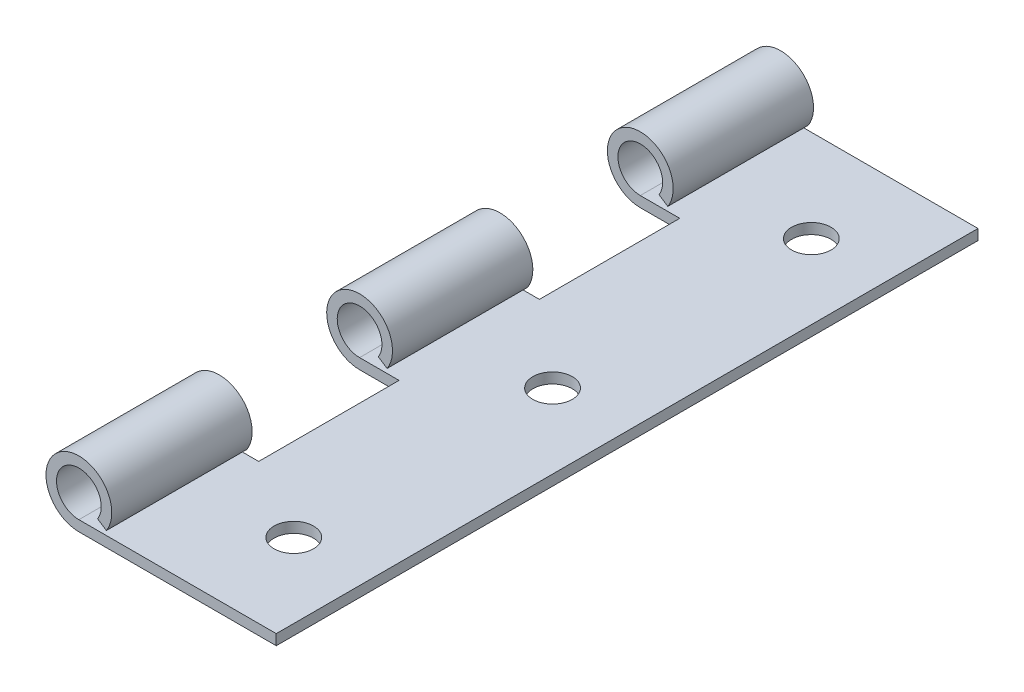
ISO-10303-21;
HEADER;
FILE_DESCRIPTION(('STEP AP214'),'2;1');
FILE_NAME('part.step','',(''),(''),'','','');
FILE_SCHEMA(('AUTOMOTIVE_DESIGN { 1 0 10303 214 1 1 1 1 }'));
ENDSEC;
DATA;
#1=APPLICATION_CONTEXT('core data for automotive mechanical design processes');
#2=APPLICATION_PROTOCOL_DEFINITION('international standard','automotive_design',2000,#1);
#3=PRODUCT_CONTEXT('',#1,'mechanical');
#4=PRODUCT('Part','Part','',(#3));
#5=PRODUCT_RELATED_PRODUCT_CATEGORY('part','',(#4));
#6=PRODUCT_DEFINITION_FORMATION('','',#4);
#7=PRODUCT_DEFINITION_CONTEXT('part definition',#1,'design');
#8=PRODUCT_DEFINITION('design','',#6,#7);
#9=PRODUCT_DEFINITION_SHAPE('','',#8);
#10=(LENGTH_UNIT() NAMED_UNIT(*) SI_UNIT(.MILLI.,.METRE.));
#11=(NAMED_UNIT(*) PLANE_ANGLE_UNIT() SI_UNIT($,.RADIAN.));
#12=(NAMED_UNIT(*) SI_UNIT($,.STERADIAN.) SOLID_ANGLE_UNIT());
#13=UNCERTAINTY_MEASURE_WITH_UNIT(LENGTH_MEASURE(1.E-05),#10,'distance_accuracy_value','');
#14=(GEOMETRIC_REPRESENTATION_CONTEXT(3) GLOBAL_UNCERTAINTY_ASSIGNED_CONTEXT((#13)) GLOBAL_UNIT_ASSIGNED_CONTEXT((#10,
#11,#12)) REPRESENTATION_CONTEXT('',''));
#15=CARTESIAN_POINT('',(0.,0.,0.));
#16=DIRECTION('',(0.,0.,1.));
#17=DIRECTION('',(1.,0.,0.));
#18=AXIS2_PLACEMENT_3D('',#15,#16,#17);
#19=CARTESIAN_POINT('',(0.,0.,40.));
#20=DIRECTION('',(0.,0.,-1.));
#21=DIRECTION('',(-1.,0.,0.));
#22=AXIS2_PLACEMENT_3D('',#19,#20,#21);
#23=CYLINDRICAL_SURFACE('',#22,3.74999999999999);
#24=DIRECTION('',(0.,0.,-1.));
#25=VECTOR('',#24,1.);
#26=CARTESIAN_POINT('',(3.14006369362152,-2.05,40.));
#27=LINE('',#26,#25);
#28=CARTESIAN_POINT('',(3.14006369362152,-2.05,8.));
#29=VERTEX_POINT('',#28);
#30=CARTESIAN_POINT('',(3.14006369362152,-2.05,-8.));
#31=VERTEX_POINT('',#30);
#32=EDGE_CURVE('E281',#29,#31,#27,.T.);
#33=ORIENTED_EDGE('',*,*,#32,.T.);
#34=CARTESIAN_POINT('',(0.,0.,-8.));
#35=DIRECTION('',(0.,0.,1.));
#36=DIRECTION('',(1.,0.,0.));
#37=AXIS2_PLACEMENT_3D('',#34,#35,#36);
#38=CIRCLE('',#37,3.74999999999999);
#39=CARTESIAN_POINT('',(0.,-3.74999999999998,-8.));
#40=VERTEX_POINT('',#39);
#41=EDGE_CURVE('E200',#31,#40,#38,.T.);
#42=ORIENTED_EDGE('',*,*,#41,.T.);
#43=DIRECTION('',(0.,0.,-1.));
#44=VECTOR('',#43,1.);
#45=CARTESIAN_POINT('',(0.,-3.74999999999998,40.));
#46=LINE('',#45,#44);
#47=CARTESIAN_POINT('',(0.,-3.74999999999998,8.));
#48=VERTEX_POINT('',#47);
#49=EDGE_CURVE('E302',#48,#40,#46,.T.);
#50=ORIENTED_EDGE('',*,*,#49,.F.);
#51=CARTESIAN_POINT('',(0.,0.,8.));
#52=DIRECTION('',(0.,0.,-1.));
#53=DIRECTION('',(-1.,0.,0.));
#54=AXIS2_PLACEMENT_3D('',#51,#52,#53);
#55=CIRCLE('',#54,3.74999999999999);
#56=EDGE_CURVE('E219',#48,#29,#55,.T.);
#57=ORIENTED_EDGE('',*,*,#56,.T.);
#58=EDGE_LOOP('',(#33,#42,#50,#57));
#59=FACE_BOUND('',#58,.T.);
#60=ADVANCED_FACE('F38',(#59),#23,.T.);
#61=CARTESIAN_POINT('',(0.,0.,40.));
#62=DIRECTION('',(0.,0.,-1.));
#63=DIRECTION('',(-1.,0.,0.));
#64=AXIS2_PLACEMENT_3D('',#61,#62,#63);
#65=CYLINDRICAL_SURFACE('',#64,2.55);
#66=DIRECTION('',(0.,0.,-1.));
#67=VECTOR('',#66,1.);
#68=CARTESIAN_POINT('',(0.,-2.55,40.));
#69=LINE('',#68,#67);
#70=CARTESIAN_POINT('',(0.,-2.55,8.));
#71=VERTEX_POINT('',#70);
#72=CARTESIAN_POINT('',(0.,-2.55,-8.));
#73=VERTEX_POINT('',#72);
#74=EDGE_CURVE('E291',#71,#73,#69,.T.);
#75=ORIENTED_EDGE('',*,*,#74,.T.);
#76=CARTESIAN_POINT('',(0.,0.,-8.));
#77=DIRECTION('',(0.,0.,1.));
#78=DIRECTION('',(1.,0.,0.));
#79=AXIS2_PLACEMENT_3D('',#76,#77,#78);
#80=CIRCLE('',#79,2.55);
#81=CARTESIAN_POINT('',(2.13524331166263,-1.394,-8.));
#82=VERTEX_POINT('',#81);
#83=EDGE_CURVE('E194',#73,#82,#80,.F.);
#84=ORIENTED_EDGE('',*,*,#83,.T.);
#85=DIRECTION('',(0.,0.,-1.));
#86=VECTOR('',#85,1.);
#87=CARTESIAN_POINT('',(2.13524331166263,-1.394,40.));
#88=LINE('',#87,#86);
#89=CARTESIAN_POINT('',(2.13524331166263,-1.394,8.));
#90=VERTEX_POINT('',#89);
#91=EDGE_CURVE('E286',#90,#82,#88,.T.);
#92=ORIENTED_EDGE('',*,*,#91,.F.);
#93=CARTESIAN_POINT('',(0.,0.,8.));
#94=DIRECTION('',(0.,0.,-1.));
#95=DIRECTION('',(-1.,0.,0.));
#96=AXIS2_PLACEMENT_3D('',#93,#94,#95);
#97=CIRCLE('',#96,2.55);
#98=EDGE_CURVE('E61',#90,#71,#97,.F.);
#99=ORIENTED_EDGE('',*,*,#98,.T.);
#100=EDGE_LOOP('',(#75,#84,#92,#99));
#101=FACE_BOUND('',#100,.T.);
#102=ADVANCED_FACE('F360',(#101),#65,.F.);
#103=CARTESIAN_POINT('',(2.13524331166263,-1.394,40.));
#104=DIRECTION('',(0.546666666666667,0.837350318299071,0.));
#105=DIRECTION('',(-0.837350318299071,0.546666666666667,0.));
#106=AXIS2_PLACEMENT_3D('',#103,#104,#105);
#107=PLANE('',#106);
#108=ORIENTED_EDGE('',*,*,#91,.T.);
#109=DIRECTION('',(0.837350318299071,-0.546666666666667,0.));
#110=VECTOR('',#109,1.);
#111=CARTESIAN_POINT('',(2.13524331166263,-1.394,-8.));
#112=LINE('',#111,#110);
#113=EDGE_CURVE('E46',#82,#31,#112,.T.);
#114=ORIENTED_EDGE('',*,*,#113,.T.);
#115=ORIENTED_EDGE('',*,*,#32,.F.);
#116=DIRECTION('',(-0.837350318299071,0.546666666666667,0.));
#117=VECTOR('',#116,1.);
#118=CARTESIAN_POINT('',(2.13524331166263,-1.394,8.));
#119=LINE('',#118,#117);
#120=EDGE_CURVE('E301',#29,#90,#119,.T.);
#121=ORIENTED_EDGE('',*,*,#120,.T.);
#122=EDGE_LOOP('',(#108,#114,#115,#121));
#123=FACE_BOUND('',#122,.T.);
#124=ADVANCED_FACE('F316',(#123),#107,.F.);
#125=CARTESIAN_POINT('',(3.14006369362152,-2.05,40.));
#126=VERTEX_POINT('',#125);
#127=CARTESIAN_POINT('',(3.14006369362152,-2.05,24.));
#128=VERTEX_POINT('',#127);
#129=EDGE_CURVE('E277',#126,#128,#27,.T.);
#130=ORIENTED_EDGE('',*,*,#129,.T.);
#131=CARTESIAN_POINT('',(0.,0.,24.));
#132=DIRECTION('',(0.,0.,1.));
#133=DIRECTION('',(1.,0.,0.));
#134=AXIS2_PLACEMENT_3D('',#131,#132,#133);
#135=CIRCLE('',#134,3.74999999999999);
#136=CARTESIAN_POINT('',(0.,-3.74999999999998,24.));
#137=VERTEX_POINT('',#136);
#138=EDGE_CURVE('E227',#128,#137,#135,.T.);
#139=ORIENTED_EDGE('',*,*,#138,.T.);
#140=CARTESIAN_POINT('',(0.,-3.74999999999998,40.));
#141=VERTEX_POINT('',#140);
#142=EDGE_CURVE('E298',#141,#137,#46,.T.);
#143=ORIENTED_EDGE('',*,*,#142,.F.);
#144=CARTESIAN_POINT('',(0.,0.,40.));
#145=DIRECTION('',(0.,0.,1.));
#146=DIRECTION('',(1.,0.,0.));
#147=AXIS2_PLACEMENT_3D('',#144,#145,#146);
#148=CIRCLE('',#147,3.74999999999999);
#149=EDGE_CURVE('E248',#126,#141,#148,.T.);
#150=ORIENTED_EDGE('',*,*,#149,.F.);
#151=EDGE_LOOP('',(#130,#139,#143,#150));
#152=FACE_BOUND('',#151,.T.);
#153=ADVANCED_FACE('F348',(#152),#23,.T.);
#154=CARTESIAN_POINT('',(0.,-2.55,40.));
#155=VERTEX_POINT('',#154);
#156=CARTESIAN_POINT('',(0.,-2.55,24.));
#157=VERTEX_POINT('',#156);
#158=EDGE_CURVE('E287',#155,#157,#69,.T.);
#159=ORIENTED_EDGE('',*,*,#158,.T.);
#160=CARTESIAN_POINT('',(0.,0.,24.));
#161=DIRECTION('',(0.,0.,1.));
#162=DIRECTION('',(1.,0.,0.));
#163=AXIS2_PLACEMENT_3D('',#160,#161,#162);
#164=CIRCLE('',#163,2.55);
#165=CARTESIAN_POINT('',(2.13524331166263,-1.394,24.));
#166=VERTEX_POINT('',#165);
#167=EDGE_CURVE('E221',#157,#166,#164,.F.);
#168=ORIENTED_EDGE('',*,*,#167,.T.);
#169=CARTESIAN_POINT('',(2.13524331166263,-1.394,40.));
#170=VERTEX_POINT('',#169);
#171=EDGE_CURVE('E282',#170,#166,#88,.T.);
#172=ORIENTED_EDGE('',*,*,#171,.F.);
#173=CARTESIAN_POINT('',(0.,0.,40.));
#174=DIRECTION('',(0.,0.,-1.));
#175=DIRECTION('',(1.,0.,0.));
#176=AXIS2_PLACEMENT_3D('',#173,#174,#175);
#177=CIRCLE('',#176,2.55);
#178=EDGE_CURVE('E258',#155,#170,#177,.T.);
#179=ORIENTED_EDGE('',*,*,#178,.F.);
#180=EDGE_LOOP('',(#159,#168,#172,#179));
#181=FACE_BOUND('',#180,.T.);
#182=ADVANCED_FACE('F371',(#181),#65,.F.);
#183=ORIENTED_EDGE('',*,*,#171,.T.);
#184=DIRECTION('',(0.837350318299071,-0.546666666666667,0.));
#185=VECTOR('',#184,1.);
#186=CARTESIAN_POINT('',(2.13524331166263,-1.394,24.));
#187=LINE('',#186,#185);
#188=EDGE_CURVE('E304',#166,#128,#187,.T.);
#189=ORIENTED_EDGE('',*,*,#188,.T.);
#190=ORIENTED_EDGE('',*,*,#129,.F.);
#191=DIRECTION('',(0.837350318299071,-0.546666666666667,0.));
#192=VECTOR('',#191,1.);
#193=CARTESIAN_POINT('',(2.13524331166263,-1.394,40.));
#194=LINE('',#193,#192);
#195=EDGE_CURVE('E260',#170,#126,#194,.T.);
#196=ORIENTED_EDGE('',*,*,#195,.F.);
#197=EDGE_LOOP('',(#183,#189,#190,#196));
#198=FACE_BOUND('',#197,.T.);
#199=ADVANCED_FACE('F374',(#198),#107,.F.);
#200=CARTESIAN_POINT('',(0.,0.,-24.));
#201=DIRECTION('',(0.,0.,-1.));
#202=DIRECTION('',(-1.,0.,0.));
#203=AXIS2_PLACEMENT_3D('',#200,#201,#202);
#204=CIRCLE('',#203,3.74999999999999);
#205=CARTESIAN_POINT('',(0.,-3.74999999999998,-24.));
#206=VERTEX_POINT('',#205);
#207=CARTESIAN_POINT('',(3.14006369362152,-2.05,-24.));
#208=VERTEX_POINT('',#207);
#209=EDGE_CURVE('E179',#206,#208,#204,.T.);
#210=ORIENTED_EDGE('',*,*,#209,.T.);
#211=CARTESIAN_POINT('',(3.14006369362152,-2.05,-40.));
#212=VERTEX_POINT('',#211);
#213=EDGE_CURVE('E262',#208,#212,#27,.T.);
#214=ORIENTED_EDGE('',*,*,#213,.T.);
#215=CARTESIAN_POINT('',(0.,0.,-40.));
#216=DIRECTION('',(0.,0.,1.));
#217=DIRECTION('',(1.,0.,0.));
#218=AXIS2_PLACEMENT_3D('',#215,#216,#217);
#219=CIRCLE('',#218,3.74999999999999);
#220=CARTESIAN_POINT('',(0.,-3.74999999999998,-40.));
#221=VERTEX_POINT('',#220);
#222=EDGE_CURVE('E245',#212,#221,#219,.T.);
#223=ORIENTED_EDGE('',*,*,#222,.T.);
#224=EDGE_CURVE('E297',#206,#221,#46,.T.);
#225=ORIENTED_EDGE('',*,*,#224,.F.);
#226=EDGE_LOOP('',(#210,#214,#223,#225));
#227=FACE_BOUND('',#226,.T.);
#228=ADVANCED_FACE('F40',(#227),#23,.T.);
#229=CARTESIAN_POINT('',(0.,-3.74999999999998,40.));
#230=DIRECTION('',(0.,1.,0.));
#231=DIRECTION('',(-1.,0.,0.));
#232=AXIS2_PLACEMENT_3D('',#229,#230,#231);
#233=PLANE('',#232);
#234=CARTESIAN_POINT('',(14.,-3.75,29.5));
#235=DIRECTION('',(0.,1.,0.));
#236=DIRECTION('',(-1.,0.,0.));
#237=AXIS2_PLACEMENT_3D('',#234,#235,#236);
#238=CIRCLE('',#237,2.25);
#239=CARTESIAN_POINT('',(11.75,-3.75,29.5));
#240=VERTEX_POINT('',#239);
#241=EDGE_CURVE('E230',#240,#240,#238,.T.);
#242=ORIENTED_EDGE('',*,*,#241,.T.);
#243=EDGE_LOOP('',(#242));
#244=FACE_BOUND('',#243,.T.);
#245=CARTESIAN_POINT('',(14.,-3.75,-29.5));
#246=DIRECTION('',(0.,1.,0.));
#247=DIRECTION('',(-1.,0.,0.));
#248=AXIS2_PLACEMENT_3D('',#245,#246,#247);
#249=CIRCLE('',#248,2.25);
#250=CARTESIAN_POINT('',(11.75,-3.75,-29.5));
#251=VERTEX_POINT('',#250);
#252=EDGE_CURVE('E236',#251,#251,#249,.T.);
#253=ORIENTED_EDGE('',*,*,#252,.T.);
#254=EDGE_LOOP('',(#253));
#255=FACE_BOUND('',#254,.T.);
#256=CARTESIAN_POINT('',(14.,-3.75,0.));
#257=DIRECTION('',(0.,1.,0.));
#258=DIRECTION('',(-1.,0.,0.));
#259=AXIS2_PLACEMENT_3D('',#256,#257,#258);
#260=CIRCLE('',#259,2.25);
#261=CARTESIAN_POINT('',(11.75,-3.75,0.));
#262=VERTEX_POINT('',#261);
#263=EDGE_CURVE('E242',#262,#262,#260,.T.);
#264=ORIENTED_EDGE('',*,*,#263,.T.);
#265=EDGE_LOOP('',(#264));
#266=FACE_BOUND('',#265,.T.);
#267=ORIENTED_EDGE('',*,*,#49,.T.);
#268=DIRECTION('',(-1.,0.,0.));
#269=VECTOR('',#268,1.);
#270=CARTESIAN_POINT('',(-3.74999999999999,-3.74999999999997,-8.));
#271=LINE('',#270,#269);
#272=CARTESIAN_POINT('',(4.5,-3.74999999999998,-8.));
#273=VERTEX_POINT('',#272);
#274=EDGE_CURVE('E174',#273,#40,#271,.T.);
#275=ORIENTED_EDGE('',*,*,#274,.F.);
#276=DIRECTION('',(0.,0.,1.));
#277=VECTOR('',#276,1.);
#278=CARTESIAN_POINT('',(4.5,-3.74999999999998,-24.));
#279=LINE('',#278,#277);
#280=CARTESIAN_POINT('',(4.5,-3.74999999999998,-24.));
#281=VERTEX_POINT('',#280);
#282=EDGE_CURVE('E170',#281,#273,#279,.T.);
#283=ORIENTED_EDGE('',*,*,#282,.F.);
#284=DIRECTION('',(1.,0.,0.));
#285=VECTOR('',#284,1.);
#286=CARTESIAN_POINT('',(-3.74999999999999,-3.74999999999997,-24.));
#287=LINE('',#286,#285);
#288=EDGE_CURVE('E177',#206,#281,#287,.T.);
#289=ORIENTED_EDGE('',*,*,#288,.F.);
#290=ORIENTED_EDGE('',*,*,#224,.T.);
#291=DIRECTION('',(1.,0.,0.));
#292=VECTOR('',#291,1.);
#293=CARTESIAN_POINT('',(0.,-3.74999999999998,-40.));
#294=LINE('',#293,#292);
#295=CARTESIAN_POINT('',(22.5,-3.75,-40.));
#296=VERTEX_POINT('',#295);
#297=EDGE_CURVE('E265',#221,#296,#294,.T.);
#298=ORIENTED_EDGE('',*,*,#297,.T.);
#299=DIRECTION('',(0.,0.,-1.));
#300=VECTOR('',#299,1.);
#301=CARTESIAN_POINT('',(22.5,-3.75,40.));
#302=LINE('',#301,#300);
#303=CARTESIAN_POINT('',(22.5,-3.75,40.));
#304=VERTEX_POINT('',#303);
#305=EDGE_CURVE('E294',#304,#296,#302,.T.);
#306=ORIENTED_EDGE('',*,*,#305,.F.);
#307=DIRECTION('',(1.,0.,0.));
#308=VECTOR('',#307,1.);
#309=CARTESIAN_POINT('',(0.,-3.74999999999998,40.));
#310=LINE('',#309,#308);
#311=EDGE_CURVE('E251',#141,#304,#310,.T.);
#312=ORIENTED_EDGE('',*,*,#311,.F.);
#313=ORIENTED_EDGE('',*,*,#142,.T.);
#314=DIRECTION('',(-1.,0.,0.));
#315=VECTOR('',#314,1.);
#316=CARTESIAN_POINT('',(-3.74999999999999,-3.74999999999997,24.));
#317=LINE('',#316,#315);
#318=CARTESIAN_POINT('',(4.5,-3.74999999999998,24.));
#319=VERTEX_POINT('',#318);
#320=EDGE_CURVE('E208',#319,#137,#317,.T.);
#321=ORIENTED_EDGE('',*,*,#320,.F.);
#322=DIRECTION('',(0.,0.,1.));
#323=VECTOR('',#322,1.);
#324=CARTESIAN_POINT('',(4.5,-3.74999999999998,24.));
#325=LINE('',#324,#323);
#326=CARTESIAN_POINT('',(4.5,-3.74999999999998,8.));
#327=VERTEX_POINT('',#326);
#328=EDGE_CURVE('E205',#327,#319,#325,.T.);
#329=ORIENTED_EDGE('',*,*,#328,.F.);
#330=DIRECTION('',(1.,0.,0.));
#331=VECTOR('',#330,1.);
#332=CARTESIAN_POINT('',(-3.74999999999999,-3.74999999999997,8.));
#333=LINE('',#332,#331);
#334=EDGE_CURVE('E202',#48,#327,#333,.T.);
#335=ORIENTED_EDGE('',*,*,#334,.F.);
#336=EDGE_LOOP('',(#267,#275,#283,#289,#290,#298,#306,#312,#313,#321,#329,#335));
#337=FACE_BOUND('',#336,.T.);
#338=ADVANCED_FACE('F184',(#244,#255,#266,#337),#233,.F.);
#339=CARTESIAN_POINT('',(22.5,-2.55,40.));
#340=DIRECTION('',(-1.,0.,0.));
#341=DIRECTION('',(0.,0.,1.));
#342=AXIS2_PLACEMENT_3D('',#339,#340,#341);
#343=PLANE('',#342);
#344=DIRECTION('',(0.,1.,0.));
#345=VECTOR('',#344,1.);
#346=CARTESIAN_POINT('',(22.5,-2.55,-40.));
#347=LINE('',#346,#345);
#348=CARTESIAN_POINT('',(22.5,-2.55,-40.));
#349=VERTEX_POINT('',#348);
#350=EDGE_CURVE('E267',#296,#349,#347,.T.);
#351=ORIENTED_EDGE('',*,*,#350,.T.);
#352=DIRECTION('',(0.,0.,-1.));
#353=VECTOR('',#352,1.);
#354=CARTESIAN_POINT('',(22.5,-2.55,40.));
#355=LINE('',#354,#353);
#356=CARTESIAN_POINT('',(22.5,-2.55,40.));
#357=VERTEX_POINT('',#356);
#358=EDGE_CURVE('E290',#357,#349,#355,.T.);
#359=ORIENTED_EDGE('',*,*,#358,.F.);
#360=DIRECTION('',(0.,1.,0.));
#361=VECTOR('',#360,1.);
#362=CARTESIAN_POINT('',(22.5,-2.55,40.));
#363=LINE('',#362,#361);
#364=EDGE_CURVE('E254',#304,#357,#363,.T.);
#365=ORIENTED_EDGE('',*,*,#364,.F.);
#366=ORIENTED_EDGE('',*,*,#305,.T.);
#367=EDGE_LOOP('',(#351,#359,#365,#366));
#368=FACE_BOUND('',#367,.T.);
#369=ADVANCED_FACE('F337',(#368),#343,.F.);
#370=CARTESIAN_POINT('',(0.,-2.55,40.));
#371=DIRECTION('',(0.,-1.,0.));
#372=DIRECTION('',(1.,0.,0.));
#373=AXIS2_PLACEMENT_3D('',#370,#371,#372);
#374=PLANE('',#373);
#375=CARTESIAN_POINT('',(14.,-2.55,29.5));
#376=DIRECTION('',(0.,1.,0.));
#377=DIRECTION('',(-1.,0.,0.));
#378=AXIS2_PLACEMENT_3D('',#375,#376,#377);
#379=CIRCLE('',#378,2.25);
#380=CARTESIAN_POINT('',(11.75,-2.55,29.5));
#381=VERTEX_POINT('',#380);
#382=EDGE_CURVE('E229',#381,#381,#379,.T.);
#383=ORIENTED_EDGE('',*,*,#382,.F.);
#384=EDGE_LOOP('',(#383));
#385=FACE_BOUND('',#384,.T.);
#386=CARTESIAN_POINT('',(14.,-2.55,-29.5));
#387=DIRECTION('',(0.,1.,0.));
#388=DIRECTION('',(-1.,0.,0.));
#389=AXIS2_PLACEMENT_3D('',#386,#387,#388);
#390=CIRCLE('',#389,2.25);
#391=CARTESIAN_POINT('',(11.75,-2.55,-29.5));
#392=VERTEX_POINT('',#391);
#393=EDGE_CURVE('E233',#392,#392,#390,.T.);
#394=ORIENTED_EDGE('',*,*,#393,.F.);
#395=EDGE_LOOP('',(#394));
#396=FACE_BOUND('',#395,.T.);
#397=CARTESIAN_POINT('',(14.,-2.55,0.));
#398=DIRECTION('',(0.,1.,0.));
#399=DIRECTION('',(-1.,0.,0.));
#400=AXIS2_PLACEMENT_3D('',#397,#398,#399);
#401=CIRCLE('',#400,2.25);
#402=CARTESIAN_POINT('',(11.75,-2.55,0.));
#403=VERTEX_POINT('',#402);
#404=EDGE_CURVE('E239',#403,#403,#401,.T.);
#405=ORIENTED_EDGE('',*,*,#404,.F.);
#406=EDGE_LOOP('',(#405));
#407=FACE_BOUND('',#406,.T.);
#408=DIRECTION('',(0.,0.,1.));
#409=VECTOR('',#408,1.);
#410=CARTESIAN_POINT('',(4.50000000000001,-2.55,40.));
#411=LINE('',#410,#409);
#412=CARTESIAN_POINT('',(4.5,-2.55,-24.));
#413=VERTEX_POINT('',#412);
#414=CARTESIAN_POINT('',(4.5,-2.55,-8.));
#415=VERTEX_POINT('',#414);
#416=EDGE_CURVE('E11',#413,#415,#411,.T.);
#417=ORIENTED_EDGE('',*,*,#416,.T.);
#418=DIRECTION('',(-1.,0.,0.));
#419=VECTOR('',#418,1.);
#420=CARTESIAN_POINT('',(0.,-2.55,-8.));
#421=LINE('',#420,#419);
#422=EDGE_CURVE('E197',#415,#73,#421,.T.);
#423=ORIENTED_EDGE('',*,*,#422,.T.);
#424=ORIENTED_EDGE('',*,*,#74,.F.);
#425=DIRECTION('',(1.,0.,0.));
#426=VECTOR('',#425,1.);
#427=CARTESIAN_POINT('',(0.,-2.55,8.));
#428=LINE('',#427,#426);
#429=CARTESIAN_POINT('',(4.5,-2.55,8.));
#430=VERTEX_POINT('',#429);
#431=EDGE_CURVE('E216',#71,#430,#428,.T.);
#432=ORIENTED_EDGE('',*,*,#431,.T.);
#433=DIRECTION('',(0.,0.,1.));
#434=VECTOR('',#433,1.);
#435=CARTESIAN_POINT('',(4.5,-2.55,40.));
#436=LINE('',#435,#434);
#437=CARTESIAN_POINT('',(4.5,-2.55,24.));
#438=VERTEX_POINT('',#437);
#439=EDGE_CURVE('E307',#430,#438,#436,.T.);
#440=ORIENTED_EDGE('',*,*,#439,.T.);
#441=DIRECTION('',(-1.,0.,0.));
#442=VECTOR('',#441,1.);
#443=CARTESIAN_POINT('',(0.,-2.55,24.));
#444=LINE('',#443,#442);
#445=EDGE_CURVE('E224',#438,#157,#444,.T.);
#446=ORIENTED_EDGE('',*,*,#445,.T.);
#447=ORIENTED_EDGE('',*,*,#158,.F.);
#448=DIRECTION('',(-1.,0.,0.));
#449=VECTOR('',#448,1.);
#450=CARTESIAN_POINT('',(0.,-2.55,40.));
#451=LINE('',#450,#449);
#452=EDGE_CURVE('E256',#357,#155,#451,.T.);
#453=ORIENTED_EDGE('',*,*,#452,.F.);
#454=ORIENTED_EDGE('',*,*,#358,.T.);
#455=DIRECTION('',(-1.,0.,0.));
#456=VECTOR('',#455,1.);
#457=CARTESIAN_POINT('',(0.,-2.55,-40.));
#458=LINE('',#457,#456);
#459=CARTESIAN_POINT('',(0.,-2.55,-40.));
#460=VERTEX_POINT('',#459);
#461=EDGE_CURVE('E269',#349,#460,#458,.T.);
#462=ORIENTED_EDGE('',*,*,#461,.T.);
#463=CARTESIAN_POINT('',(0.,-2.55,-24.));
#464=VERTEX_POINT('',#463);
#465=EDGE_CURVE('E285',#464,#460,#69,.T.);
#466=ORIENTED_EDGE('',*,*,#465,.F.);
#467=DIRECTION('',(1.,0.,0.));
#468=VECTOR('',#467,1.);
#469=CARTESIAN_POINT('',(0.,-2.55,-24.));
#470=LINE('',#469,#468);
#471=EDGE_CURVE('E191',#464,#413,#470,.T.);
#472=ORIENTED_EDGE('',*,*,#471,.T.);
#473=EDGE_LOOP('',(#417,#423,#424,#432,#440,#446,#447,#453,#454,#462,#466,#472));
#474=FACE_BOUND('',#473,.T.);
#475=ADVANCED_FACE('F364',(#385,#396,#407,#474),#374,.F.);
#476=CARTESIAN_POINT('',(2.13524331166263,-1.394,-24.));
#477=VERTEX_POINT('',#476);
#478=CARTESIAN_POINT('',(2.13524331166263,-1.394,-40.));
#479=VERTEX_POINT('',#478);
#480=EDGE_CURVE('E280',#477,#479,#88,.T.);
#481=ORIENTED_EDGE('',*,*,#480,.F.);
#482=CARTESIAN_POINT('',(0.,0.,-24.));
#483=DIRECTION('',(0.,0.,-1.));
#484=DIRECTION('',(-1.,0.,0.));
#485=AXIS2_PLACEMENT_3D('',#482,#483,#484);
#486=CIRCLE('',#485,2.55);
#487=EDGE_CURVE('E53',#477,#464,#486,.F.);
#488=ORIENTED_EDGE('',*,*,#487,.T.);
#489=ORIENTED_EDGE('',*,*,#465,.T.);
#490=CARTESIAN_POINT('',(0.,0.,-40.));
#491=DIRECTION('',(0.,0.,-1.));
#492=DIRECTION('',(1.,0.,0.));
#493=AXIS2_PLACEMENT_3D('',#490,#491,#492);
#494=CIRCLE('',#493,2.55);
#495=EDGE_CURVE('E272',#460,#479,#494,.T.);
#496=ORIENTED_EDGE('',*,*,#495,.T.);
#497=EDGE_LOOP('',(#481,#488,#489,#496));
#498=FACE_BOUND('',#497,.T.);
#499=ADVANCED_FACE('F367',(#498),#65,.F.);
#500=ORIENTED_EDGE('',*,*,#213,.F.);
#501=DIRECTION('',(-0.837350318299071,0.546666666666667,0.));
#502=VECTOR('',#501,1.);
#503=CARTESIAN_POINT('',(2.13524331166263,-1.394,-24.));
#504=LINE('',#503,#502);
#505=EDGE_CURVE('E310',#208,#477,#504,.T.);
#506=ORIENTED_EDGE('',*,*,#505,.T.);
#507=ORIENTED_EDGE('',*,*,#480,.T.);
#508=DIRECTION('',(0.837350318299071,-0.546666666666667,0.));
#509=VECTOR('',#508,1.);
#510=CARTESIAN_POINT('',(2.13524331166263,-1.394,-40.));
#511=LINE('',#510,#509);
#512=EDGE_CURVE('E252',#479,#212,#511,.T.);
#513=ORIENTED_EDGE('',*,*,#512,.T.);
#514=EDGE_LOOP('',(#500,#506,#507,#513));
#515=FACE_BOUND('',#514,.T.);
#516=ADVANCED_FACE('F326',(#515),#107,.F.);
#517=CARTESIAN_POINT('',(0.,0.,40.));
#518=DIRECTION('',(0.,0.,1.));
#519=DIRECTION('',(1.,0.,0.));
#520=AXIS2_PLACEMENT_3D('',#517,#518,#519);
#521=PLANE('',#520);
#522=ORIENTED_EDGE('',*,*,#149,.T.);
#523=ORIENTED_EDGE('',*,*,#311,.T.);
#524=ORIENTED_EDGE('',*,*,#364,.T.);
#525=ORIENTED_EDGE('',*,*,#452,.T.);
#526=ORIENTED_EDGE('',*,*,#178,.T.);
#527=ORIENTED_EDGE('',*,*,#195,.T.);
#528=EDGE_LOOP('',(#522,#523,#524,#525,#526,#527));
#529=FACE_BOUND('',#528,.T.);
#530=ADVANCED_FACE('F341',(#529),#521,.T.);
#531=CARTESIAN_POINT('',(0.,0.,-40.));
#532=DIRECTION('',(0.,0.,1.));
#533=DIRECTION('',(1.,0.,0.));
#534=AXIS2_PLACEMENT_3D('',#531,#532,#533);
#535=PLANE('',#534);
#536=ORIENTED_EDGE('',*,*,#222,.F.);
#537=ORIENTED_EDGE('',*,*,#512,.F.);
#538=ORIENTED_EDGE('',*,*,#495,.F.);
#539=ORIENTED_EDGE('',*,*,#461,.F.);
#540=ORIENTED_EDGE('',*,*,#350,.F.);
#541=ORIENTED_EDGE('',*,*,#297,.F.);
#542=EDGE_LOOP('',(#536,#537,#538,#539,#540,#541));
#543=FACE_BOUND('',#542,.T.);
#544=ADVANCED_FACE('F331',(#543),#535,.F.);
#545=CARTESIAN_POINT('',(14.,-3.75,0.));
#546=DIRECTION('',(0.,1.,0.));
#547=DIRECTION('',(-1.,0.,0.));
#548=AXIS2_PLACEMENT_3D('',#545,#546,#547);
#549=CYLINDRICAL_SURFACE('',#548,2.25);
#550=ORIENTED_EDGE('',*,*,#263,.F.);
#551=EDGE_LOOP('',(#550));
#552=FACE_BOUND('',#551,.T.);
#553=ORIENTED_EDGE('',*,*,#404,.T.);
#554=EDGE_LOOP('',(#553));
#555=FACE_BOUND('',#554,.T.);
#556=ADVANCED_FACE('F464',(#552,#555),#549,.F.);
#557=CARTESIAN_POINT('',(14.,-3.75,-29.5));
#558=DIRECTION('',(0.,1.,0.));
#559=DIRECTION('',(-1.,0.,0.));
#560=AXIS2_PLACEMENT_3D('',#557,#558,#559);
#561=CYLINDRICAL_SURFACE('',#560,2.25);
#562=ORIENTED_EDGE('',*,*,#252,.F.);
#563=EDGE_LOOP('',(#562));
#564=FACE_BOUND('',#563,.T.);
#565=ORIENTED_EDGE('',*,*,#393,.T.);
#566=EDGE_LOOP('',(#565));
#567=FACE_BOUND('',#566,.T.);
#568=ADVANCED_FACE('F472',(#564,#567),#561,.F.);
#569=CARTESIAN_POINT('',(14.,-3.75,29.5));
#570=DIRECTION('',(0.,1.,0.));
#571=DIRECTION('',(-1.,0.,0.));
#572=AXIS2_PLACEMENT_3D('',#569,#570,#571);
#573=CYLINDRICAL_SURFACE('',#572,2.25);
#574=ORIENTED_EDGE('',*,*,#241,.F.);
#575=EDGE_LOOP('',(#574));
#576=FACE_BOUND('',#575,.T.);
#577=ORIENTED_EDGE('',*,*,#382,.T.);
#578=EDGE_LOOP('',(#577));
#579=FACE_BOUND('',#578,.T.);
#580=ADVANCED_FACE('F482',(#576,#579),#573,.F.);
#581=CARTESIAN_POINT('',(4.50000000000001,3.75000000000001,24.));
#582=DIRECTION('',(1.,0.,0.));
#583=DIRECTION('',(0.,1.,0.));
#584=AXIS2_PLACEMENT_3D('',#581,#582,#583);
#585=PLANE('',#584);
#586=DIRECTION('',(0.,-1.,0.));
#587=VECTOR('',#586,1.);
#588=CARTESIAN_POINT('',(4.50000000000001,3.75000000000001,8.));
#589=LINE('',#588,#587);
#590=EDGE_CURVE('E211',#430,#327,#589,.T.);
#591=ORIENTED_EDGE('',*,*,#590,.T.);
#592=ORIENTED_EDGE('',*,*,#328,.T.);
#593=DIRECTION('',(0.,-1.,0.));
#594=VECTOR('',#593,1.);
#595=CARTESIAN_POINT('',(4.50000000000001,3.75000000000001,24.));
#596=LINE('',#595,#594);
#597=EDGE_CURVE('E212',#438,#319,#596,.T.);
#598=ORIENTED_EDGE('',*,*,#597,.F.);
#599=ORIENTED_EDGE('',*,*,#439,.F.);
#600=EDGE_LOOP('',(#591,#592,#598,#599));
#601=FACE_BOUND('',#600,.T.);
#602=ADVANCED_FACE('F354',(#601),#585,.F.);
#603=CARTESIAN_POINT('',(-3.74999999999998,3.75000000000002,24.));
#604=DIRECTION('',(0.,0.,1.));
#605=DIRECTION('',(1.,0.,0.));
#606=AXIS2_PLACEMENT_3D('',#603,#604,#605);
#607=PLANE('',#606);
#608=ORIENTED_EDGE('',*,*,#138,.F.);
#609=ORIENTED_EDGE('',*,*,#188,.F.);
#610=ORIENTED_EDGE('',*,*,#167,.F.);
#611=ORIENTED_EDGE('',*,*,#445,.F.);
#612=ORIENTED_EDGE('',*,*,#597,.T.);
#613=ORIENTED_EDGE('',*,*,#320,.T.);
#614=EDGE_LOOP('',(#608,#609,#610,#611,#612,#613));
#615=FACE_BOUND('',#614,.T.);
#616=ADVANCED_FACE('F351',(#615),#607,.F.);
#617=CARTESIAN_POINT('',(-3.74999999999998,3.75000000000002,8.));
#618=DIRECTION('',(0.,0.,-1.));
#619=DIRECTION('',(-1.,0.,0.));
#620=AXIS2_PLACEMENT_3D('',#617,#618,#619);
#621=PLANE('',#620);
#622=ORIENTED_EDGE('',*,*,#334,.T.);
#623=ORIENTED_EDGE('',*,*,#590,.F.);
#624=ORIENTED_EDGE('',*,*,#431,.F.);
#625=ORIENTED_EDGE('',*,*,#98,.F.);
#626=ORIENTED_EDGE('',*,*,#120,.F.);
#627=ORIENTED_EDGE('',*,*,#56,.F.);
#628=EDGE_LOOP('',(#622,#623,#624,#625,#626,#627));
#629=FACE_BOUND('',#628,.T.);
#630=ADVANCED_FACE('F357',(#629),#621,.F.);
#631=CARTESIAN_POINT('',(4.50000000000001,3.75000000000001,-24.));
#632=DIRECTION('',(1.,0.,0.));
#633=DIRECTION('',(0.,1.,0.));
#634=AXIS2_PLACEMENT_3D('',#631,#632,#633);
#635=PLANE('',#634);
#636=DIRECTION('',(0.,-1.,0.));
#637=VECTOR('',#636,1.);
#638=CARTESIAN_POINT('',(4.50000000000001,3.75000000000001,-24.));
#639=LINE('',#638,#637);
#640=EDGE_CURVE('E165',#413,#281,#639,.T.);
#641=ORIENTED_EDGE('',*,*,#640,.T.);
#642=ORIENTED_EDGE('',*,*,#282,.T.);
#643=DIRECTION('',(0.,-1.,0.));
#644=VECTOR('',#643,1.);
#645=CARTESIAN_POINT('',(4.50000000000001,3.75000000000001,-8.));
#646=LINE('',#645,#644);
#647=EDGE_CURVE('E173',#415,#273,#646,.T.);
#648=ORIENTED_EDGE('',*,*,#647,.F.);
#649=ORIENTED_EDGE('',*,*,#416,.F.);
#650=EDGE_LOOP('',(#641,#642,#648,#649));
#651=FACE_BOUND('',#650,.T.);
#652=ADVANCED_FACE('F167',(#651),#635,.F.);
#653=CARTESIAN_POINT('',(-3.74999999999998,3.75000000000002,-8.));
#654=DIRECTION('',(0.,0.,1.));
#655=DIRECTION('',(1.,0.,0.));
#656=AXIS2_PLACEMENT_3D('',#653,#654,#655);
#657=PLANE('',#656);
#658=ORIENTED_EDGE('',*,*,#41,.F.);
#659=ORIENTED_EDGE('',*,*,#113,.F.);
#660=ORIENTED_EDGE('',*,*,#83,.F.);
#661=ORIENTED_EDGE('',*,*,#422,.F.);
#662=ORIENTED_EDGE('',*,*,#647,.T.);
#663=ORIENTED_EDGE('',*,*,#274,.T.);
#664=EDGE_LOOP('',(#658,#659,#660,#661,#662,#663));
#665=FACE_BOUND('',#664,.T.);
#666=ADVANCED_FACE('F362',(#665),#657,.F.);
#667=CARTESIAN_POINT('',(-3.74999999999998,3.75000000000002,-24.));
#668=DIRECTION('',(0.,0.,-1.));
#669=DIRECTION('',(-1.,0.,0.));
#670=AXIS2_PLACEMENT_3D('',#667,#668,#669);
#671=PLANE('',#670);
#672=ORIENTED_EDGE('',*,*,#288,.T.);
#673=ORIENTED_EDGE('',*,*,#640,.F.);
#674=ORIENTED_EDGE('',*,*,#471,.F.);
#675=ORIENTED_EDGE('',*,*,#487,.F.);
#676=ORIENTED_EDGE('',*,*,#505,.F.);
#677=ORIENTED_EDGE('',*,*,#209,.F.);
#678=EDGE_LOOP('',(#672,#673,#674,#675,#676,#677));
#679=FACE_BOUND('',#678,.T.);
#680=ADVANCED_FACE('F178',(#679),#671,.F.);
#681=CLOSED_SHELL('',(#60,#102,#124,#153,#182,#199,#228,#338,#369,#475,#499,#516,#530,#544,#556,
#568,#580,#602,#616,#630,#652,#666,#680));
#682=MANIFOLD_SOLID_BREP('B2',#681);
#683=ADVANCED_BREP_SHAPE_REPRESENTATION('',(#18,#682),#14);
#684=SHAPE_DEFINITION_REPRESENTATION(#9,#683);
ENDSEC;
END-ISO-10303-21;
